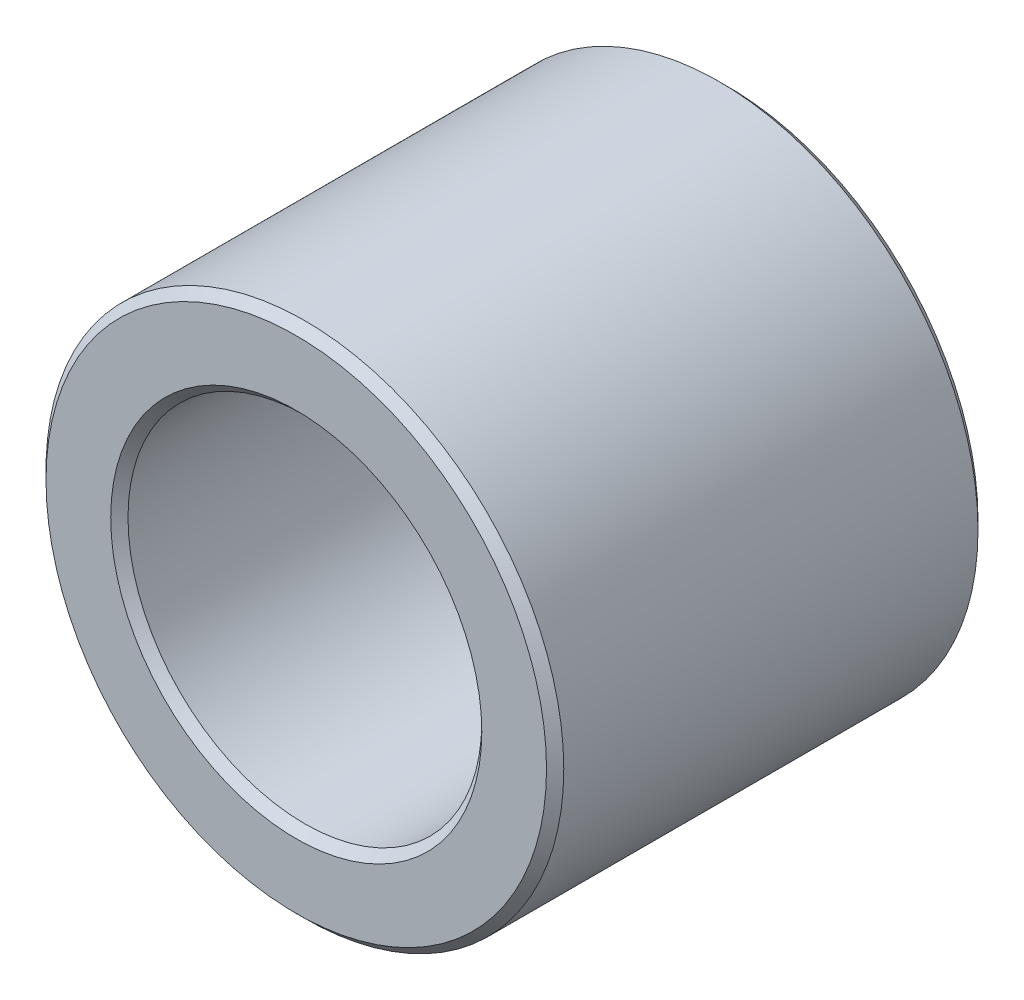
from build123d import *

# Parameters (mm, degrees)
SKETCH1_R           = 6
SKETCH1_R_2         = 4.1
BOSS_EXTRUDE2_DEPTH = 5
CHAMFER3_SIZE       = 0.2


with BuildPart() as part:
    # Sketch1 → Boss-Extrude2 (new, symmetric)
    with BuildSketch(Plane.XY):
        Circle(SKETCH1_R)
        Circle(SKETCH1_R_2, mode=Mode.SUBTRACT)
    extrude(amount=BOSS_EXTRUDE2_DEPTH, both=True)

    # Chamfer3
    chamfer3_edges = [part.edges().sort_by_distance(p)[0] for p in [
        (-6, 0, -5),
        (-6, 0, 5),
        (-4.1, 0, -5),
        (-4.1, 0, 5),
    ]]
    chamfer(chamfer3_edges, length=CHAMFER3_SIZE)


solid = part.part
